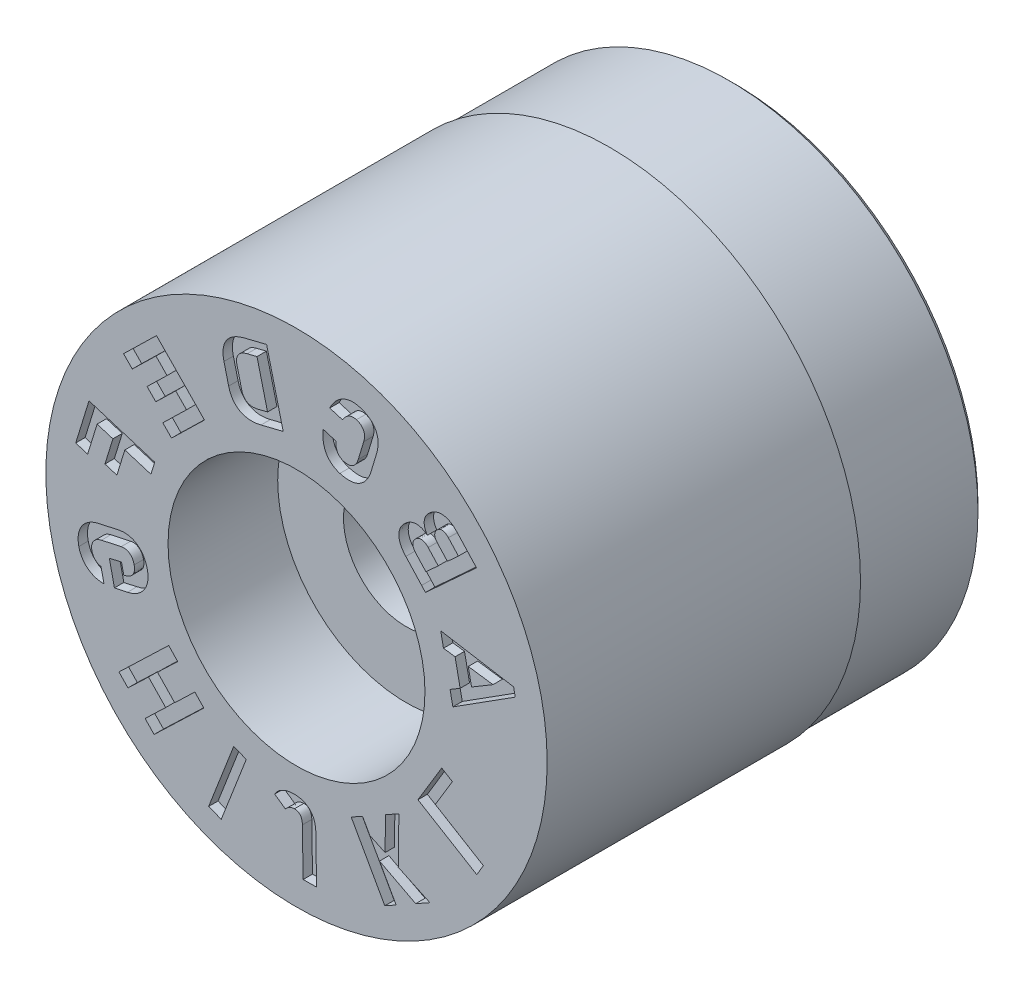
from build123d import *

# Parameters (mm, degrees)
SKETCH4_W          = 4
SKETCH4_H          = 1
CUT_EXTRUDE1_DEPTH = 0.3


with BuildPart() as part:
    # Sketch1 → Revolve1 (revolve)
    with BuildSketch(Plane(origin=(0, 0, 0), x_dir=(0, 0, -1), z_dir=(1, 0, 0)), mode=Mode.PRIVATE) as revolve1_sk:
        Polygon((0, 8), (0, 4.1), (3.5, 4.1), (3.5, 2), (14, 2), (14, 7.75), (13.75, 8), align=None)
    revolve(revolve1_sk.sketch.rotate(Axis((0, 0, 3.797909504), (0, 0, -1)), 90), axis=Axis((0, 0, 3.797909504), (0, 0, -1)))

    # Sketch4 → Cut-Revolve1 (revolve, cut)
    with BuildSketch(Plane(origin=(0, 0, 0), x_dir=(0, 0, -1), z_dir=(1, 0, 0)), mode=Mode.PRIVATE) as cut_revolve1_sk:
        with Locations((12, 8.435)):
            Rectangle(SKETCH4_W, SKETCH4_H)
    revolve(cut_revolve1_sk.sketch.rotate(Axis((0, 0, 0), (0, 0, -1)), 90), axis=Axis((0, 0, 0), (0, 0, -1)), mode=Mode.SUBTRACT)

    # Sketch6 → Cut-Extrude1 (cut)
    # profile 1 of 12: a face of its own
    with BuildSketch(Plane.XY):
        with BuildLine():
            Line((-2.315114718, 5.924123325), (-2.165363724, 5.318418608))
            add(Edge.make_bspline(
                [(-2.165363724, 5.318418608), (-2.155827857, 5.281112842), (-2.139925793, 5.226247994), (-2.112135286, 5.156578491), (-2.089027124, 5.107643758), (-2.063086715, 5.061571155), (-2.035125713, 5.017690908), (-2.004279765, 4.976759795), (-1.971411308, 4.938120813), (-1.935976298, 4.902535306), (-1.897938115, 4.870095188), (-1.857626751, 4.84060843), (-1.814815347, 4.814355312), (-1.769528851, 4.79140145), (-1.722038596, 4.771429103), (-1.672143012, 4.754233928), (-1.619965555, 4.740447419), (-1.565559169, 4.729902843), (-1.509200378, 4.722989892), (-1.450895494, 4.720472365), (-1.390712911, 4.721067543), (-1.32868348, 4.725532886), (-1.241618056, 4.736141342), (-1.175890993, 4.749324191), (-1.131806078, 4.760636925)],
                knots=[0, 0, 0, 0, 0.086689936, 0.128284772, 0.168675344, 0.20837113, 0.247191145, 0.285671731, 0.323607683, 0.36126386, 0.398545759, 0.43599564, 0.473542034, 0.511424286, 0.550134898, 0.589389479, 0.630086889, 0.671473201, 0.714011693, 0.757730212, 0.802700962, 0.849378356, 0.897595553, 1, 1, 1, 1], degree=3))
            Line((-1.131806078, 4.760636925), (-0.42554374, 4.934970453))
            Line((-0.42554374, 4.934970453), (-0.954187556, 7.074094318))
            Line((-0.954187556, 7.074094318), (-1.661639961, 6.899134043))
            add(Edge.make_bspline(
                [(-1.661639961, 6.899134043), (-1.704687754, 6.888348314), (-1.767566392, 6.870350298), (-1.848008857, 6.840628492), (-1.903807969, 6.816141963), (-1.956838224, 6.789980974), (-2.006449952, 6.761395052), (-2.052808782, 6.730252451), (-2.096193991, 6.69729071), (-2.136681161, 6.662642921), (-2.173099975, 6.625331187), (-2.206601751, 6.586646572), (-2.236176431, 6.545701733), (-2.262074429, 6.502850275), (-2.284861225, 6.458468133), (-2.304322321, 6.41212538), (-2.319818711, 6.363766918), (-2.332023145, 6.313855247), (-2.340535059, 6.262383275), (-2.345718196, 6.209486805), (-2.346866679, 6.15510169), (-2.344365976, 6.099304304), (-2.336565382, 6.021656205), (-2.324801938, 5.963224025), (-2.315114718, 5.924123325)],
                knots=[0, 0, 0, 0, 0.09972958, 0.146796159, 0.192588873, 0.236590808, 0.279606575, 0.321140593, 0.361992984, 0.401987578, 0.440750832, 0.479038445, 0.516883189, 0.554086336, 0.591445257, 0.62889462, 0.666889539, 0.705429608, 0.744249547, 0.784019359, 0.824757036, 0.86636565, 0.909454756, 1, 1, 1, 1], degree=3))
        make_face()
        with BuildLine():
            Line((-1.745131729, 5.409507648), (-1.900610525, 6.039558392))
            add(Edge.make_bspline(
                [(-1.900610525, 6.039558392), (-1.907356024, 6.06708337), (-1.914909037, 6.108275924), (-1.915664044, 6.162744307), (-1.912669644, 6.201030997), (-1.905232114, 6.237599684), (-1.894311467, 6.272681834), (-1.878399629, 6.305800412), (-1.859119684, 6.337399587), (-1.835676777, 6.366778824), (-1.809440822, 6.394830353), (-1.778321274, 6.419129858), (-1.744840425, 6.442332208), (-1.707076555, 6.462083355), (-1.651474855, 6.487924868), (-1.60559032, 6.500235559), (-1.574588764, 6.508698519)],
                knots=[0, 0, 0, 0, 0.131132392, 0.192273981, 0.251268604, 0.308207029, 0.364357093, 0.420562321, 0.477521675, 0.535010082, 0.593964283, 0.654494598, 0.717020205, 0.781928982, 0.851101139, 1, 1, 1, 1], degree=3))
            Line((-1.574588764, 6.508698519), (-1.26126362, 6.586182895))
            Line((-1.26126362, 6.586182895), (-0.924521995, 5.223579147))
            Line((-0.924521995, 5.223579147), (-1.23800406, 5.146055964))
            add(Edge.make_bspline(
                [(-1.23800406, 5.146055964), (-1.269359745, 5.138266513), (-1.315819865, 5.129661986), (-1.377068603, 5.124916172), (-1.419601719, 5.126081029), (-1.460212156, 5.129812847), (-1.498507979, 5.138462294), (-1.535236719, 5.149240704), (-1.569227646, 5.165160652), (-1.601136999, 5.18382414), (-1.63032508, 5.206247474), (-1.656450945, 5.232221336), (-1.680558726, 5.260864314), (-1.700952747, 5.29337935), (-1.7249938, 5.34222382), (-1.738783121, 5.381696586), (-1.745131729, 5.409507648)],
                knots=[0, 0, 0, 0, 0.14922798, 0.217861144, 0.283381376, 0.345617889, 0.405909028, 0.464495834, 0.522085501, 0.578807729, 0.635036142, 0.691590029, 0.748735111, 0.807622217, 0.868397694, 1, 1, 1, 1], degree=3))
        make_face(mode=Mode.SUBTRACT)
    # profile 2 of 12: a face of its own
    with BuildSketch(Plane.XY):
        Polygon((-5.519226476, 4.537369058), (-5.241053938, 4.252422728), (-4.485585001, 4.989221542), (-4.132032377, 4.626738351), (-4.768640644, 4.005718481), (-4.490905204, 3.721231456), (-3.854428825, 4.342122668), (-3.511100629, 3.990122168), (-4.266598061, 3.253295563), (-3.988873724, 2.968360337), (-2.937811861, 3.993552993), (-4.468164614, 5.562561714), align=None)
    # profile 3 of 12: a face of its own
    with BuildSketch(Plane.XY):
        Polygon((-7.046795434, 1.304437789), (-6.665639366, 1.187193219), (-6.362996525, 2.169603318), (-5.85964826, 2.014498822), (-6.11348286, 1.190578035), (-5.732326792, 1.073333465), (-5.478550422, 1.897065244), (-4.645870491, 1.640478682), (-4.524262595, 2.036018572), (-6.6222222, 2.682495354), align=None)
    # profile 4 of 12: a face of its own
    with BuildSketch(Plane.XY):
        Polygon((-3.244279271, -3.67724846), (-3.887713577, -4.294948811), (-4.434946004, -3.724909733), (-3.791422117, -3.107123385), (-4.078770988, -2.808027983), (-5.666731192, -4.332478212), (-5.379382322, -4.631573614), (-4.722940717, -4.001386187), (-4.17570829, -4.571425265), (-4.832239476, -5.201698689), (-4.544890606, -5.50079409), (-2.956930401, -3.976343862), align=None)
    # profile 5 of 12: a face of its own
    with BuildSketch(Plane.XY):
        Polygon((-2.803762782, -6.618900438), (-2.401957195, -6.774680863), (-1.603000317, -4.717781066), (-2.004805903, -4.562000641), align=None)
    # profile 6 of 12: a face of its own
    with BuildSketch(Plane.XY):
        with BuildLine():
            Line((0.639571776, -7.125920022), (0.617634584, -5.624899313))
            add(Edge.make_bspline(
                [(0.617634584, -5.624899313), (0.61719176, -5.588255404), (0.614035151, -5.534181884), (0.604222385, -5.463753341), (0.594201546, -5.413920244), (0.582270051, -5.366102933), (0.567400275, -5.320552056), (0.5501334, -5.277076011), (0.523640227, -5.222678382), (0.484555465, -5.159839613), (0.42830757, -5.09268538), (0.361330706, -5.03683437), (0.299259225, -4.998242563), (0.245777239, -4.972231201), (0.202808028, -4.956169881), (0.158140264, -4.942127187), (0.111374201, -4.930818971), (0.062690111, -4.922608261), (-0.00598336, -4.913742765), (-0.058863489, -4.913195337), (-0.094617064, -4.913115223)],
                knots=[0, 0, 0, 0, 0.096031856, 0.141745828, 0.186235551, 0.229181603, 0.270820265, 0.311708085, 0.351672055, 0.429252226, 0.505033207, 0.580195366, 0.656772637, 0.696008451, 0.735864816, 0.776859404, 0.818661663, 0.861826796, 0.906192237, 1, 1, 1, 1], degree=3))
            add(Edge.make_bspline(
                [(-0.094617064, -4.913115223), (-0.15880521, -4.914339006), (-0.253675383, -4.923747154), (-0.372715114, -4.960058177), (-0.454254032, -4.995240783), (-0.528728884, -5.039476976), (-0.616422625, -5.10975232), (-0.669137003, -5.175384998), (-0.697158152, -5.223086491)],
                knots=[0, 0, 0, 0, 0.272328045, 0.400217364, 0.525732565, 0.647568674, 0.765919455, 1, 1, 1, 1], degree=3))
            Line((-0.697158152, -5.223086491), (-0.354356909, -5.464983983))
            add(Edge.make_bspline(
                [(-0.354356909, -5.464983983), (-0.336932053, -5.442331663), (-0.307576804, -5.410970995), (-0.262313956, -5.376356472), (-0.225572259, -5.355438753), (-0.187417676, -5.338003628), (-0.134851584, -5.320723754), (-0.093478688, -5.316211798), (-0.06616089, -5.315527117)],
                knots=[0, 0, 0, 0, 0.25512666, 0.381406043, 0.507403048, 0.631821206, 0.755557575, 1, 1, 1, 1], degree=3))
            add(Edge.make_bspline(
                [(-0.06616089, -5.315527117), (-0.030437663, -5.315605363), (0.024081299, -5.322694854), (0.084614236, -5.359661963), (0.121800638, -5.396775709), (0.150976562, -5.443583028), (0.180941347, -5.521747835), (0.187107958, -5.587633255), (0.188183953, -5.633041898)],
                knots=[0, 0, 0, 0, 0.23538966, 0.345421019, 0.457097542, 0.575101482, 0.702417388, 1, 1, 1, 1], degree=3))
            Line((0.188183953, -5.633041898), (0.210070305, -7.132269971))
            Line((0.210070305, -7.132269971), (0.639571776, -7.125920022))
        make_face()
    # profile 7 of 12: a face of its own
    with BuildSketch(Plane.XY):
        Polygon((3.267369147, -3.786249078), (2.838828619, -4.025886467), (2.827966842, -5.078532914), (2.339894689, -4.850277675), (2.107717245, -4.435099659), (1.746414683, -4.637053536), (2.818162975, -6.553546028), (3.179465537, -6.351592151), (2.648664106, -5.402416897), (3.803999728, -6.00223569), (4.258971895, -5.747766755), (3.247213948, -5.274600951), align=None)
    # profile 8 of 12: a face of its own
    with BuildSketch(Plane.XY):
        Polygon((4.974777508, -2.043210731), (4.634002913, -1.837777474), (4.089260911, -2.740642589), (3.875916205, -3.094243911), (5.752296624, -4.225144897), (5.964941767, -3.872426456), (4.429951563, -2.946214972), align=None)
    # profile 9 of 12: a face of its own
    with BuildSketch(Plane.XY):
        Polygon((5.061872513, 1.450536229), (5.223078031, 0.659524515), (4.901421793, 0.467570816), (4.990499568, 0.029514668), (6.981655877, 1.294864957), (6.929006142, 1.553068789), (4.601807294, 1.939442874), (4.690885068, 1.501386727), align=None)
        Polygon((5.586937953, 0.876663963), (5.481712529, 1.392989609), (6.270883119, 1.284819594), align=None, mode=Mode.SUBTRACT)
    # profile 10 of 12: a face of its own
    with BuildSketch(Plane.XY):
        with BuildLine():
            Line((3.475860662, 4.349308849), (3.471980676, 4.346041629))
            add(Edge.make_bspline(
                [(3.471980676, 4.346041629), (3.427781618, 4.306517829), (3.371097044, 4.240498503), (3.313686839, 4.142914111), (3.285204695, 4.068218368), (3.26872074, 3.991650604), (3.263554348, 3.913559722), (3.271823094, 3.834397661), (3.291291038, 3.754262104), (3.323017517, 3.674001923), (3.383714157, 3.563737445), (3.443878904, 3.487045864), (3.489064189, 3.437859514)],
                knots=[0, 0, 0, 0, 0.172247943, 0.251439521, 0.328386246, 0.403802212, 0.478628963, 0.55514675, 0.634504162, 0.717946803, 0.80552171, 1, 1, 1, 1], degree=3))
            Line((3.489064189, 3.437859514), (3.993263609, 2.889300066))
            Line((3.993263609, 2.889300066), (4.116780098, 2.755414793))
            Line((4.116780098, 2.755414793), (5.743951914, 4.25160036))
            Line((5.743951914, 4.25160036), (5.1335421, 4.915461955))
            add(Edge.make_bspline(
                [(5.1335421, 4.915461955), (5.088440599, 4.964163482), (5.017787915, 5.031169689), (4.912484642, 5.099449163), (4.835523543, 5.138205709), (4.757777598, 5.164515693), (4.679982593, 5.17853611), (4.602371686, 5.180989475), (4.525297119, 5.170007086), (4.449334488, 5.147456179), (4.347534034, 5.099564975), (4.277896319, 5.047907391), (4.23474297, 5.007820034)],
                knots=[0, 0, 0, 0, 0.194493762, 0.282692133, 0.366302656, 0.445926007, 0.521873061, 0.596750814, 0.67204466, 0.748593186, 0.827700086, 1, 1, 1, 1], degree=3))
            add(Edge.make_bspline(
                [(4.23474297, 5.007820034), (4.204701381, 4.980231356), (4.16459691, 4.93509781), (4.122664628, 4.868084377), (4.099831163, 4.81617654), (4.08390526, 4.7628204), (4.074909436, 4.708040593), (4.074169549, 4.652051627), (4.07939462, 4.59497642), (4.0929143, 4.537294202), (4.120687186, 4.458100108), (4.151254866, 4.401236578), (4.175573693, 4.364916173)],
                knots=[0, 0, 0, 0, 0.172073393, 0.253315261, 0.332706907, 0.410641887, 0.487804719, 0.566182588, 0.64635221, 0.729136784, 0.81553361, 1, 1, 1, 1], degree=3))
            add(Edge.make_bspline(
                [(4.175573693, 4.364916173), (4.140184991, 4.395081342), (4.083245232, 4.433224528), (4.002247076, 4.4710006), (3.941729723, 4.489476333), (3.881222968, 4.501060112), (3.820581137, 4.50316207), (3.760121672, 4.498231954), (3.700336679, 4.484064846), (3.641487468, 4.46243854), (3.563021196, 4.421996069), (3.509798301, 4.380071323), (3.475860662, 4.349308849)],
                knots=[0, 0, 0, 0, 0.179926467, 0.264185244, 0.345402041, 0.424518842, 0.502196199, 0.579789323, 0.658904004, 0.739474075, 0.822220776, 1, 1, 1, 1], degree=3))
        make_face()
        with BuildLine():
            add(Edge.make_bspline(
                [(4.498180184, 4.31205838), (4.472498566, 4.340744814), (4.438080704, 4.386119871), (4.415009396, 4.454563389), (4.409133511, 4.503410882), (4.415195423, 4.551311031), (4.438853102, 4.615144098), (4.472430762, 4.656082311), (4.498685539, 4.680101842)],
                knots=[0, 0, 0, 0, 0.27843931, 0.400073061, 0.51501027, 0.62886984, 0.743440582, 1, 1, 1, 1], degree=3))
            add(Edge.make_bspline(
                [(4.498685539, 4.680101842), (4.522247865, 4.702030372), (4.562597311, 4.728730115), (4.623645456, 4.742805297), (4.669370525, 4.741863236), (4.715468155, 4.730361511), (4.779706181, 4.699301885), (4.82116558, 4.661244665), (4.847443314, 4.633101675)],
                knots=[0, 0, 0, 0, 0.243028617, 0.353982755, 0.466706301, 0.583917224, 0.708815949, 1, 1, 1, 1], degree=3))
            Line((4.847443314, 4.633101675), (5.16644141, 4.28617228))
            Line((5.16644141, 4.28617228), (4.817230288, 3.965072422))
            Line((4.817230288, 3.965072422), (4.498180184, 4.31205838))
        make_face(mode=Mode.SUBTRACT)
        with BuildLine():
            Line((3.802342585, 4.079226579), (3.805290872, 4.082123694))
            add(Edge.make_bspline(
                [(3.805290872, 4.082123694), (3.824505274, 4.099713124), (3.855009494, 4.123243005), (3.90022921, 4.1443455), (3.933880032, 4.154101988), (3.967927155, 4.159298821), (4.002314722, 4.157720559), (4.036926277, 4.151907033), (4.071127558, 4.139390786), (4.105457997, 4.122568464), (4.151750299, 4.091544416), (4.183300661, 4.062171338), (4.203096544, 4.040368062)],
                knots=[0, 0, 0, 0, 0.172168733, 0.251660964, 0.327830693, 0.402693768, 0.477731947, 0.553965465, 0.633359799, 0.717034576, 0.805717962, 1, 1, 1, 1], degree=3))
            Line((4.203096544, 4.040368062), (4.521966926, 3.693577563))
            Line((4.521966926, 3.693577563), (4.130242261, 3.333386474))
            Line((4.130242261, 3.333386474), (3.81133218, 3.680220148))
            add(Edge.make_bspline(
                [(3.81133218, 3.680220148), (3.782652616, 3.711758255), (3.745418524, 3.761885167), (3.717940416, 3.836507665), (3.71032334, 3.889647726), (3.715096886, 3.941715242), (3.739230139, 4.010141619), (3.77426244, 4.05410117), (3.802342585, 4.079226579)],
                knots=[0, 0, 0, 0, 0.283579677, 0.406779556, 0.523553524, 0.636466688, 0.749848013, 1, 1, 1, 1], degree=3))
        make_face(mode=Mode.SUBTRACT)
    # profile 11 of 12: a face of its own
    with BuildSketch(Plane.XY):
        with BuildLine():
            Line((1.261513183, 5.508971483), (0.85147351, 5.632759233))
            add(Edge.make_bspline(
                [(0.85147351, 5.632759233), (0.842847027, 5.556562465), (0.83706297, 5.444030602), (0.852075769, 5.298421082), (0.872983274, 5.198505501), (0.904225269, 5.105376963), (0.944673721, 5.019264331), (0.996074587, 4.941282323), (1.056054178, 4.870666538), (1.125426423, 4.808589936), (1.231757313, 4.737319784), (1.321727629, 4.699414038), (1.384487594, 4.680391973)],
                knots=[0, 0, 0, 0, 0.192196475, 0.280691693, 0.365901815, 0.447264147, 0.52613754, 0.603429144, 0.680429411, 0.757535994, 0.835747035, 1, 1, 1, 1], degree=3))
            add(Edge.make_bspline(
                [(1.384487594, 4.680391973), (1.423110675, 4.668767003), (1.480894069, 4.654114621), (1.557857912, 4.641213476), (1.613452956, 4.635825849), (1.667534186, 4.633337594), (1.720458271, 4.634188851), (1.771833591, 4.639600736), (1.822094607, 4.647396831), (1.870786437, 4.659072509), (1.91789853, 4.674309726), (1.963111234, 4.693023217), (2.00673002, 4.715052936), (2.048327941, 4.740580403), (2.088634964, 4.769075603), (2.127166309, 4.800992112), (2.163850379, 4.836523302), (2.198162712, 4.875458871), (2.23100526, 4.917064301), (2.26138533, 4.961983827), (2.289662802, 5.010075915), (2.315734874, 5.061421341), (2.348057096, 5.135306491), (2.368756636, 5.193293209), (2.380758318, 5.233157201)],
                knots=[0, 0, 0, 0, 0.093408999, 0.13786317, 0.180595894, 0.222678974, 0.26319589, 0.303034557, 0.342218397, 0.380913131, 0.418857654, 0.456773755, 0.494121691, 0.531903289, 0.569697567, 0.608350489, 0.647654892, 0.687839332, 0.728452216, 0.770331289, 0.813315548, 0.857575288, 0.903607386, 1, 1, 1, 1], degree=3))
            Line((2.380758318, 5.233157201), (2.554733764, 5.809674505))
            add(Edge.make_bspline(
                [(2.554733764, 5.809674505), (2.5668645, 5.849561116), (2.582443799, 5.909035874), (2.595686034, 5.988539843), (2.60202638, 6.045618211), (2.605331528, 6.10136412), (2.604907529, 6.155708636), (2.600741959, 6.208571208), (2.593574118, 6.260054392), (2.582600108, 6.309721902), (2.568568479, 6.357832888), (2.550956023, 6.403915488), (2.53006381, 6.448252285), (2.506002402, 6.490772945), (2.478849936, 6.531539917), (2.448319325, 6.570514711), (2.414018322, 6.607059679), (2.377024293, 6.642199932), (2.336709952, 6.674938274), (2.29346519, 6.705395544), (2.247077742, 6.733544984), (2.197763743, 6.759459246), (2.126439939, 6.791423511), (2.070305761, 6.811367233), (2.031570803, 6.822842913)],
                knots=[0, 0, 0, 0, 0.096527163, 0.142046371, 0.186449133, 0.229401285, 0.27123284, 0.312130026, 0.352060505, 0.391447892, 0.429758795, 0.467960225, 0.505512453, 0.54310449, 0.58094241, 0.618791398, 0.657554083, 0.696850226, 0.736812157, 0.777643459, 0.819189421, 0.862318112, 0.906504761, 1, 1, 1, 1], degree=3))
            add(Edge.make_bspline(
                [(2.031570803, 6.822842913), (1.968704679, 6.841717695), (1.872629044, 6.860712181), (1.744430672, 6.859306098), (1.652159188, 6.846458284), (1.562690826, 6.822064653), (1.476928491, 6.784707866), (1.395160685, 6.73580929), (1.317648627, 6.675237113), (1.244791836, 6.603825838), (1.151955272, 6.491122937), (1.095236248, 6.394030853), (1.061065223, 6.325649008)],
                knots=[0, 0, 0, 0, 0.164532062, 0.242887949, 0.320011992, 0.397204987, 0.474318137, 0.553481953, 0.63512535, 0.720032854, 0.808420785, 1, 1, 1, 1], degree=3))
            Line((1.061065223, 6.325649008), (1.471104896, 6.201861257))
            add(Edge.make_bspline(
                [(1.471104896, 6.201861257), (1.48816782, 6.232384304), (1.516142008, 6.275541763), (1.560727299, 6.325428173), (1.594891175, 6.357569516), (1.630885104, 6.384925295), (1.668254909, 6.407233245), (1.707225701, 6.423598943), (1.74689255, 6.435616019), (1.787592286, 6.442224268), (1.843329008, 6.442890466), (1.885036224, 6.436033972), (1.912017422, 6.427225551)],
                knots=[0, 0, 0, 0, 0.1949073, 0.284820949, 0.372021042, 0.455711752, 0.536106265, 0.613659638, 0.690481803, 0.766447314, 0.842394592, 1, 1, 1, 1], degree=3))
            add(Edge.make_bspline(
                [(1.912017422, 6.427225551), (1.946500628, 6.416678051), (1.995876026, 6.396944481), (2.053031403, 6.358483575), (2.088129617, 6.325542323), (2.118056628, 6.289237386), (2.140561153, 6.248070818), (2.157776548, 6.203557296), (2.168150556, 6.15519434), (2.172152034, 6.103729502), (2.168316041, 6.028676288), (2.155628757, 5.971901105), (2.144321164, 5.933711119)],
                knots=[0, 0, 0, 0, 0.174748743, 0.255028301, 0.331954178, 0.406980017, 0.481694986, 0.557948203, 0.637227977, 0.720132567, 0.807077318, 1, 1, 1, 1], degree=3))
            Line((2.144321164, 5.933711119), (1.970345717, 5.357193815))
            add(Edge.make_bspline(
                [(1.970345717, 5.357193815), (1.958598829, 5.319310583), (1.937973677, 5.26484272), (1.898958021, 5.200660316), (1.867213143, 5.160101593), (1.832110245, 5.125588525), (1.793037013, 5.098653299), (1.751692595, 5.076722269), (1.706740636, 5.062957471), (1.659358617, 5.055394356), (1.590620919, 5.054915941), (1.538716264, 5.066154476), (1.504040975, 5.076009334)],
                knots=[0, 0, 0, 0, 0.192670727, 0.280441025, 0.363320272, 0.441932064, 0.518110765, 0.592728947, 0.667998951, 0.744932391, 0.824737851, 1, 1, 1, 1], degree=3))
            add(Edge.make_bspline(
                [(1.504040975, 5.076009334), (1.476616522, 5.084888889), (1.436509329, 5.100743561), (1.389880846, 5.132818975), (1.358997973, 5.160412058), (1.331918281, 5.192072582), (1.308847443, 5.227439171), (1.290628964, 5.266728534), (1.275467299, 5.309043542), (1.265344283, 5.354844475), (1.25692762, 5.421736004), (1.258204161, 5.473679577), (1.261513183, 5.508971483)],
                knots=[0, 0, 0, 0, 0.15996278, 0.236029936, 0.312029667, 0.388459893, 0.465863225, 0.544840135, 0.627516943, 0.714071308, 0.803748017, 1, 1, 1, 1], degree=3))
        make_face()
    # profile 12 of 12: a face of its own
    with BuildSketch(Plane.XY):
        with BuildLine():
            Line((-5.686162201, -0.416474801), (-6.316977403, -0.553657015))
            add(Edge.make_bspline(
                [(-6.316977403, -0.553657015), (-6.355539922, -0.562341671), (-6.412328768, -0.577146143), (-6.484847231, -0.603538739), (-6.535861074, -0.625911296), (-6.584500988, -0.650568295), (-6.630970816, -0.677575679), (-6.674972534, -0.707486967), (-6.716172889, -0.7401472), (-6.754628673, -0.774956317), (-6.790088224, -0.811767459), (-6.822328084, -0.850775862), (-6.851367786, -0.891787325), (-6.877968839, -0.934352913), (-6.901047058, -0.979037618), (-6.920769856, -1.025745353), (-6.93742394, -1.074232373), (-6.951292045, -1.124200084), (-6.96054013, -1.175672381), (-6.967558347, -1.22791261), (-6.970109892, -1.281387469), (-6.970122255, -1.335821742), (-6.964092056, -1.410804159), (-6.956081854, -1.467274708), (-6.947298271, -1.504807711)],
                knots=[0, 0, 0, 0, 0.092244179, 0.136656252, 0.179891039, 0.222110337, 0.263806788, 0.305187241, 0.346111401, 0.386354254, 0.426103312, 0.465239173, 0.504286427, 0.54325267, 0.582237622, 0.621471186, 0.661418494, 0.701769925, 0.742297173, 0.783316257, 0.824639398, 0.86708121, 0.910210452, 1, 1, 1, 1], degree=3))
            add(Edge.make_bspline(
                [(-6.947298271, -1.504807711), (-6.934008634, -1.56661452), (-6.904933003, -1.656693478), (-6.845933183, -1.766591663), (-6.793839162, -1.842077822), (-6.733547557, -1.910353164), (-6.666041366, -1.970549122), (-6.591713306, -2.022222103), (-6.511079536, -2.06466881), (-6.425212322, -2.097978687), (-6.303772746, -2.130247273), (-6.20858244, -2.137170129), (-6.1448616, -2.136487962)],
                knots=[0, 0, 0, 0, 0.170730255, 0.253606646, 0.335993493, 0.417805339, 0.498917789, 0.579598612, 0.661589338, 0.744332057, 0.827763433, 1, 1, 1, 1], degree=3))
            Line((-6.1448616, -2.136487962), (-6.23960608, -1.701182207))
            add(Edge.make_bspline(
                [(-6.23960608, -1.701182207), (-6.26342752, -1.699617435), (-6.297965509, -1.690620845), (-6.341792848, -1.672370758), (-6.3725391, -1.654202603), (-6.401531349, -1.632994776), (-6.428129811, -1.60842685), (-6.451938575, -1.580705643), (-6.495234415, -1.520719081), (-6.519008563, -1.462339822), (-6.529388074, -1.414062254)],
                knots=[0, 0, 0, 0, 0.163403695, 0.244249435, 0.32618791, 0.408641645, 0.491198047, 0.574875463, 0.65983373, 1, 1, 1, 1], degree=3))
            add(Edge.make_bspline(
                [(-6.529388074, -1.414062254), (-6.536208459, -1.38020718), (-6.54275758, -1.329072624), (-6.535620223, -1.262237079), (-6.524884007, -1.2150691), (-6.506748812, -1.170744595), (-6.482984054, -1.129583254), (-6.453178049, -1.091991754), (-6.417404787, -1.058578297), (-6.376561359, -1.029096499), (-6.314236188, -0.995194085), (-6.262111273, -0.979489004), (-6.226418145, -0.971159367)],
                knots=[0, 0, 0, 0, 0.172070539, 0.252891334, 0.332752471, 0.411492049, 0.48973699, 0.568062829, 0.648791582, 0.7320392, 0.817586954, 1, 1, 1, 1], degree=3))
            Line((-6.226418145, -0.971159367), (-5.595602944, -0.833977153))
            add(Edge.make_bspline(
                [(-5.595602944, -0.833977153), (-5.563965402, -0.82659056), (-5.516057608, -0.822794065), (-5.453307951, -0.828999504), (-5.409077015, -0.840451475), (-5.367320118, -0.858221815), (-5.328280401, -0.881224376), (-5.293619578, -0.911176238), (-5.261865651, -0.945556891), (-5.234539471, -0.985507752), (-5.202667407, -1.046074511), (-5.188101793, -1.096651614), (-5.179981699, -1.131166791)],
                knots=[0, 0, 0, 0, 0.168953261, 0.248599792, 0.327822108, 0.40613098, 0.484587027, 0.563012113, 0.644082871, 0.727994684, 0.814612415, 1, 1, 1, 1], degree=3))
            add(Edge.make_bspline(
                [(-5.179981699, -1.131166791), (-5.172321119, -1.1654577), (-5.167135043, -1.21695071), (-5.171572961, -1.28450743), (-5.182694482, -1.331384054), (-5.198682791, -1.37568058), (-5.221992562, -1.416276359), (-5.251130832, -1.453227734), (-5.286093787, -1.486692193), (-5.32689937, -1.515186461), (-5.389225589, -1.549685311), (-5.442341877, -1.564328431), (-5.478500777, -1.573023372)],
                knots=[0, 0, 0, 0, 0.174479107, 0.255992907, 0.335533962, 0.413326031, 0.489455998, 0.567251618, 0.646709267, 0.729223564, 0.81417294, 1, 1, 1, 1], degree=3))
            Line((-5.478500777, -1.573023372), (-5.513478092, -1.580613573))
            Line((-5.513478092, -1.580613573), (-5.583882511, -1.256916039))
            Line((-5.583882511, -1.256916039), (-5.972675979, -1.341268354))
            Line((-5.972675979, -1.341268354), (-5.811526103, -2.082876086))
            Line((-5.811526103, -2.082876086), (-5.393429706, -1.992538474))
            add(Edge.make_bspline(
                [(-5.393429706, -1.992538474), (-5.354864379, -1.983858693), (-5.298083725, -1.969039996), (-5.225552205, -1.942670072), (-5.17443697, -1.920175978), (-5.125526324, -1.895656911), (-5.079313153, -1.867891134), (-5.035180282, -1.838163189), (-4.993946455, -1.805312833), (-4.955200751, -1.77061068), (-4.91965927, -1.733495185), (-4.887077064, -1.694600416), (-4.858044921, -1.65356206), (-4.83163695, -1.610898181), (-4.809102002, -1.565864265), (-4.788701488, -1.519235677), (-4.772139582, -1.470578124), (-4.75838985, -1.42072523), (-4.748671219, -1.369455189), (-4.742011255, -1.31723433), (-4.738553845, -1.263794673), (-4.739445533, -1.209345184), (-4.745142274, -1.134425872), (-4.753358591, -1.077953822), (-4.762071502, -1.040421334)],
                knots=[0, 0, 0, 0, 0.092156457, 0.136526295, 0.179719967, 0.222247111, 0.263940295, 0.305281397, 0.346166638, 0.386703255, 0.426414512, 0.465826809, 0.50483693, 0.543476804, 0.582640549, 0.622094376, 0.662003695, 0.702316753, 0.742521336, 0.783501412, 0.824948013, 0.867207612, 0.910295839, 1, 1, 1, 1], degree=3))
            add(Edge.make_bspline(
                [(-4.762071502, -1.040421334), (-4.769995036, -1.002440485), (-4.785303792, -0.94688604), (-4.811124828, -0.87578621), (-4.832462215, -0.825294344), (-4.85686399, -0.777506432), (-4.883658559, -0.731815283), (-4.912664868, -0.688346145), (-4.944690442, -0.647698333), (-4.978699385, -0.609744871), (-5.01451502, -0.574467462), (-5.052295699, -0.542538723), (-5.091813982, -0.513400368), (-5.133357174, -0.48740296), (-5.176829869, -0.464480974), (-5.222044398, -0.444439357), (-5.269075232, -0.428009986), (-5.317577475, -0.414812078), (-5.367176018, -0.4040797), (-5.417920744, -0.397987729), (-5.469581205, -0.394756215), (-5.522358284, -0.394442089), (-5.595030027, -0.400355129), (-5.649846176, -0.407844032), (-5.686162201, -0.416474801)],
                knots=[0, 0, 0, 0, 0.092648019, 0.137413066, 0.180620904, 0.223495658, 0.265481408, 0.307090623, 0.348217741, 0.388977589, 0.428754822, 0.468199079, 0.507032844, 0.54594365, 0.585143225, 0.624334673, 0.6639723, 0.704011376, 0.74435168, 0.785067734, 0.82595245, 0.867963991, 0.910998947, 1, 1, 1, 1], degree=3))
        make_face()
    extrude(amount=-CUT_EXTRUDE1_DEPTH, mode=Mode.SUBTRACT)


solid = part.part
